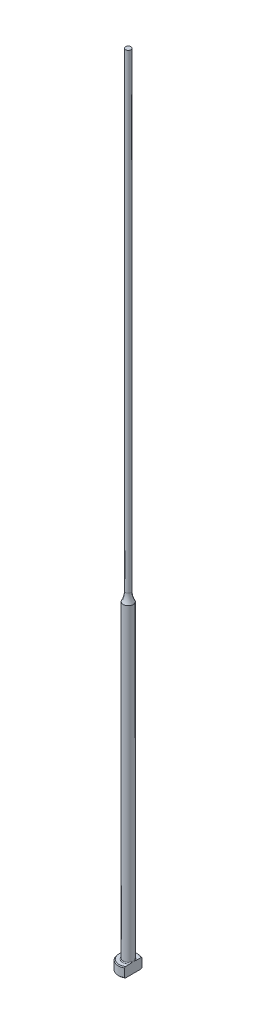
ISO-10303-21;
HEADER;
FILE_DESCRIPTION(('STEP AP214'),'2;1');
FILE_NAME('part.step','',(''),(''),'','','');
FILE_SCHEMA(('AUTOMOTIVE_DESIGN { 1 0 10303 214 1 1 1 1 }'));
ENDSEC;
DATA;
#1=APPLICATION_CONTEXT('core data for automotive mechanical design processes');
#2=APPLICATION_PROTOCOL_DEFINITION('international standard','automotive_design',2000,#1);
#3=PRODUCT_CONTEXT('',#1,'mechanical');
#4=PRODUCT('Part','Part','',(#3));
#5=PRODUCT_RELATED_PRODUCT_CATEGORY('part','',(#4));
#6=PRODUCT_DEFINITION_FORMATION('','',#4);
#7=PRODUCT_DEFINITION_CONTEXT('part definition',#1,'design');
#8=PRODUCT_DEFINITION('design','',#6,#7);
#9=PRODUCT_DEFINITION_SHAPE('','',#8);
#10=(LENGTH_UNIT() NAMED_UNIT(*) SI_UNIT(.MILLI.,.METRE.));
#11=(NAMED_UNIT(*) PLANE_ANGLE_UNIT() SI_UNIT($,.RADIAN.));
#12=(NAMED_UNIT(*) SI_UNIT($,.STERADIAN.) SOLID_ANGLE_UNIT());
#13=UNCERTAINTY_MEASURE_WITH_UNIT(LENGTH_MEASURE(1.E-05),#10,'distance_accuracy_value','');
#14=(GEOMETRIC_REPRESENTATION_CONTEXT(3) GLOBAL_UNCERTAINTY_ASSIGNED_CONTEXT((#13)) GLOBAL_UNIT_ASSIGNED_CONTEXT((#10,
#11,#12)) REPRESENTATION_CONTEXT('',''));
#15=CARTESIAN_POINT('',(0.,0.,0.));
#16=DIRECTION('',(0.,0.,1.));
#17=DIRECTION('',(1.,0.,0.));
#18=AXIS2_PLACEMENT_3D('',#15,#16,#17);
#19=CARTESIAN_POINT('',(-3.17499999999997,3.175,0.));
#20=DIRECTION('',(0.,1.,0.));
#21=DIRECTION('',(0.,0.,1.));
#22=AXIS2_PLACEMENT_3D('',#19,#20,#21);
#23=PLANE('',#22);
#24=CARTESIAN_POINT('',(0.,3.175,0.));
#25=DIRECTION('',(0.,1.,0.));
#26=DIRECTION('',(0.,0.,1.));
#27=AXIS2_PLACEMENT_3D('',#24,#25,#26);
#28=CIRCLE('',#27,2.92099999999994);
#29=CARTESIAN_POINT('',(1.58749999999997,3.175,-2.45195529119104));
#30=VERTEX_POINT('',#29);
#31=CARTESIAN_POINT('',(1.58749999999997,3.175,2.45195529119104));
#32=VERTEX_POINT('',#31);
#33=EDGE_CURVE('E105',#30,#32,#28,.T.);
#34=ORIENTED_EDGE('',*,*,#33,.T.);
#35=DIRECTION('',(0.,0.,1.));
#36=VECTOR('',#35,1.);
#37=CARTESIAN_POINT('',(1.58749999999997,3.17499999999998,2.74963065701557));
#38=LINE('',#37,#36);
#39=CARTESIAN_POINT('',(1.58749999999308,3.175,0.933255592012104));
#40=VERTEX_POINT('',#39);
#41=EDGE_CURVE('E126',#40,#32,#38,.T.);
#42=ORIENTED_EDGE('',*,*,#41,.F.);
#43=CARTESIAN_POINT('',(0.,3.175,0.));
#44=DIRECTION('',(0.,1.,0.));
#45=DIRECTION('',(0.,0.,1.));
#46=AXIS2_PLACEMENT_3D('',#43,#44,#45);
#47=CIRCLE('',#46,1.84149999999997);
#48=CARTESIAN_POINT('',(1.58749999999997,3.17500000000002,-0.933255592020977));
#49=VERTEX_POINT('',#48);
#50=EDGE_CURVE('E11',#40,#49,#47,.F.);
#51=ORIENTED_EDGE('',*,*,#50,.T.);
#52=EDGE_CURVE('E52',#30,#49,#38,.T.);
#53=ORIENTED_EDGE('',*,*,#52,.F.);
#54=EDGE_LOOP('',(#34,#42,#51,#53));
#55=FACE_BOUND('',#54,.T.);
#56=ADVANCED_FACE('F32',(#55),#23,.T.);
#57=CARTESIAN_POINT('',(0.,259.958771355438,0.));
#58=DIRECTION('',(0.,1.,0.));
#59=DIRECTION('',(0.,0.,1.));
#60=AXIS2_PLACEMENT_3D('',#57,#58,#59);
#61=CYLINDRICAL_SURFACE('',#60,3.17499999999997);
#62=CARTESIAN_POINT('',(0.,2.92100000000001,0.));
#63=DIRECTION('',(0.,1.,0.));
#64=DIRECTION('',(0.,0.,1.));
#65=AXIS2_PLACEMENT_3D('',#62,#63,#64);
#66=CIRCLE('',#65,3.17499999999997);
#67=CARTESIAN_POINT('',(1.58749999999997,2.92100000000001,2.74963065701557));
#68=VERTEX_POINT('',#67);
#69=CARTESIAN_POINT('',(1.58749999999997,2.92100000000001,-2.74963065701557));
#70=VERTEX_POINT('',#69);
#71=EDGE_CURVE('E98',#68,#70,#66,.F.);
#72=ORIENTED_EDGE('',*,*,#71,.T.);
#73=DIRECTION('',(0.,-1.,0.));
#74=VECTOR('',#73,1.);
#75=CARTESIAN_POINT('',(1.58749999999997,254.001,-2.74963065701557));
#76=LINE('',#75,#74);
#77=CARTESIAN_POINT('',(1.58749999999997,0.253999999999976,-2.74963065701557));
#78=VERTEX_POINT('',#77);
#79=EDGE_CURVE('E141',#70,#78,#76,.T.);
#80=ORIENTED_EDGE('',*,*,#79,.T.);
#81=CARTESIAN_POINT('',(0.,0.253999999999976,0.));
#82=DIRECTION('',(0.,-1.,0.));
#83=DIRECTION('',(0.,0.,-1.));
#84=AXIS2_PLACEMENT_3D('',#81,#82,#83);
#85=CIRCLE('',#84,3.17499999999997);
#86=CARTESIAN_POINT('',(1.58749999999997,0.253999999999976,2.74963065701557));
#87=VERTEX_POINT('',#86);
#88=EDGE_CURVE('E95',#78,#87,#85,.F.);
#89=ORIENTED_EDGE('',*,*,#88,.T.);
#90=DIRECTION('',(0.,-1.,0.));
#91=VECTOR('',#90,1.);
#92=CARTESIAN_POINT('',(1.58749999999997,254.001,2.74963065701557));
#93=LINE('',#92,#91);
#94=EDGE_CURVE('E88',#68,#87,#93,.T.);
#95=ORIENTED_EDGE('',*,*,#94,.F.);
#96=EDGE_LOOP('',(#72,#80,#89,#95));
#97=FACE_BOUND('',#96,.T.);
#98=ADVANCED_FACE('F191',(#97),#61,.T.);
#99=CARTESIAN_POINT('',(0.,0.,0.));
#100=DIRECTION('',(0.,-1.,0.));
#101=DIRECTION('',(0.,0.,-1.));
#102=AXIS2_PLACEMENT_3D('',#99,#100,#101);
#103=PLANE('',#102);
#104=CARTESIAN_POINT('',(0.,0.,0.));
#105=DIRECTION('',(0.,-1.,0.));
#106=DIRECTION('',(0.,0.,-1.));
#107=AXIS2_PLACEMENT_3D('',#104,#105,#106);
#108=CIRCLE('',#107,2.92100000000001);
#109=CARTESIAN_POINT('',(1.58749999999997,0.,2.45195529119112));
#110=VERTEX_POINT('',#109);
#111=CARTESIAN_POINT('',(1.58749999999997,0.,-2.45195529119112));
#112=VERTEX_POINT('',#111);
#113=EDGE_CURVE('E93',#110,#112,#108,.T.);
#114=ORIENTED_EDGE('',*,*,#113,.T.);
#115=DIRECTION('',(0.,0.,1.));
#116=VECTOR('',#115,1.);
#117=CARTESIAN_POINT('',(1.58749999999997,0.,2.74963065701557));
#118=LINE('',#117,#116);
#119=EDGE_CURVE('E78',#112,#110,#118,.T.);
#120=ORIENTED_EDGE('',*,*,#119,.T.);
#121=EDGE_LOOP('',(#114,#120));
#122=FACE_BOUND('',#121,.T.);
#123=ADVANCED_FACE('F97',(#122),#103,.T.);
#124=CARTESIAN_POINT('',(0.,3.17499999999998,0.));
#125=DIRECTION('',(0.,-1.,0.));
#126=DIRECTION('',(0.,0.,-1.));
#127=AXIS2_PLACEMENT_3D('',#124,#125,#126);
#128=CONICAL_SURFACE('',#127,2.92099999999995,0.785398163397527);
#129=ORIENTED_EDGE('',*,*,#71,.F.);
#130=CARTESIAN_POINT('',(1.58749999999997,-0.16162066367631,-6.0529050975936));
#131=CARTESIAN_POINT('',(1.58749999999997,-0.0288893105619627,-5.91567682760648));
#132=CARTESIAN_POINT('',(1.58749999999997,0.103699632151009,-5.7783103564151));
#133=CARTESIAN_POINT('',(1.58749999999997,0.368508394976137,-5.50321874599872));
#134=CARTESIAN_POINT('',(1.58749999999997,0.500728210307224,-5.36549360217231));
#135=CARTESIAN_POINT('',(1.58749999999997,0.764778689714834,-5.08953516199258));
#136=CARTESIAN_POINT('',(1.58749999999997,0.896609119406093,-4.9513016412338));
#137=CARTESIAN_POINT('',(1.58749999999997,1.15968706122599,-4.67428233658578));
#138=CARTESIAN_POINT('',(1.58749999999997,1.29093457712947,-4.53549655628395));
#139=CARTESIAN_POINT('',(1.58749999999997,1.55007705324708,-4.25997724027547));
#140=CARTESIAN_POINT('',(1.58749999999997,1.67798684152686,-4.12325766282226));
#141=CARTESIAN_POINT('',(1.58749999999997,1.9328486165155,-3.84892898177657));
#142=CARTESIAN_POINT('',(1.58749999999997,2.05980060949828,-3.71131988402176));
#143=CARTESIAN_POINT('',(1.58749999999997,2.31237508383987,-3.43493978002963));
#144=CARTESIAN_POINT('',(1.58749999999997,2.43799784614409,-3.29616903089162));
#145=CARTESIAN_POINT('',(1.58749999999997,2.68741369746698,-3.01699558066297));
#146=CARTESIAN_POINT('',(1.58749999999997,2.81120686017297,-2.8765929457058));
#147=CARTESIAN_POINT('',(1.58749999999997,3.00875865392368,-2.64816703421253));
#148=CARTESIAN_POINT('',(1.58749999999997,3.08336151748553,-2.56087478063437));
#149=CARTESIAN_POINT('',(1.58749999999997,3.2312387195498,-2.38515423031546));
#150=CARTESIAN_POINT('',(1.58749999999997,3.30451292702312,-2.29672582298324));
#151=CARTESIAN_POINT('',(1.58749999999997,3.45004422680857,-2.1174740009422));
#152=CARTESIAN_POINT('',(1.58749999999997,3.5222823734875,-2.02663514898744));
#153=CARTESIAN_POINT('',(1.58749999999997,3.66423097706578,-1.8430252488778));
#154=CARTESIAN_POINT('',(1.58749999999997,3.73394203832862,-1.75025467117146));
#155=CARTESIAN_POINT('',(1.58749999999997,3.87080633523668,-1.5606747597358));
#156=CARTESIAN_POINT('',(1.58749999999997,3.93790459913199,-1.46382547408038));
#157=CARTESIAN_POINT('',(1.58749999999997,4.06669147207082,-1.26632594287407));
#158=CARTESIAN_POINT('',(1.58749999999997,4.1283726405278,-1.16567073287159));
#159=CARTESIAN_POINT('',(1.58749999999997,4.21402252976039,-1.01165766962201));
#160=CARTESIAN_POINT('',(1.58749999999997,4.24127929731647,-0.960142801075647));
#161=CARTESIAN_POINT('',(1.58749999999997,4.2930979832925,-0.855780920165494));
#162=CARTESIAN_POINT('',(1.58749999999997,4.31765941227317,-0.802933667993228));
#163=CARTESIAN_POINT('',(1.58749999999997,4.38614656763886,-0.642461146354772));
#164=CARTESIAN_POINT('',(1.58749999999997,4.42510149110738,-0.532518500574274));
#165=CARTESIAN_POINT('',(1.58749999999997,4.46726244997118,-0.367680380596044));
#166=CARTESIAN_POINT('',(1.58749999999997,4.47844427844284,-0.314802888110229));
#167=CARTESIAN_POINT('',(1.58749999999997,4.49576654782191,-0.208209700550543));
#168=CARTESIAN_POINT('',(1.58749999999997,4.50190743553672,-0.154494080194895));
#169=CARTESIAN_POINT('',(1.58749999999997,4.50871296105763,-0.0468792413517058));
#170=CARTESIAN_POINT('',(1.58749999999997,4.5093945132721,0.00701889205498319));
#171=CARTESIAN_POINT('',(1.58749999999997,4.50527679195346,0.114606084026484));
#172=CARTESIAN_POINT('',(1.58749999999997,4.50047706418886,0.168295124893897));
#173=CARTESIAN_POINT('',(1.58749999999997,4.48579689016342,0.27448544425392));
#174=CARTESIAN_POINT('',(1.58749999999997,4.47596081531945,0.32699298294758));
#175=CARTESIAN_POINT('',(1.58749999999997,4.45181809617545,0.430974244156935));
#176=CARTESIAN_POINT('',(1.58749999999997,4.4375096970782,0.482447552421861));
#177=CARTESIAN_POINT('',(1.58749999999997,4.40502489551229,0.584460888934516));
#178=CARTESIAN_POINT('',(1.58749999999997,4.386827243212,0.634994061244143));
#179=CARTESIAN_POINT('',(1.58749999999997,4.34729308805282,0.734789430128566));
#180=CARTESIAN_POINT('',(1.58749999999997,4.3259572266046,0.784051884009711));
#181=CARTESIAN_POINT('',(1.58749999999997,4.25791922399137,0.930549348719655));
#182=CARTESIAN_POINT('',(1.58749999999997,4.20736047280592,1.0259880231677));
#183=CARTESIAN_POINT('',(1.58749999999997,4.0995545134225,1.21304313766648));
#184=CARTESIAN_POINT('',(1.58749999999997,4.04229912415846,1.30465471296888));
#185=CARTESIAN_POINT('',(1.58749999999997,3.92308746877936,1.48526211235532));
#186=CARTESIAN_POINT('',(1.58749999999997,3.86111349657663,1.57424615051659));
#187=CARTESIAN_POINT('',(1.58749999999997,3.73408621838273,1.74990003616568));
#188=CARTESIAN_POINT('',(1.58749999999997,3.66903444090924,1.83657099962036));
#189=CARTESIAN_POINT('',(1.58749999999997,3.53583371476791,2.00931764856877));
#190=CARTESIAN_POINT('',(1.58749999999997,3.46765527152,2.09537048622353));
#191=CARTESIAN_POINT('',(1.58749999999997,3.32960643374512,2.26611736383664));
#192=CARTESIAN_POINT('',(1.58749999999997,3.25973586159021,2.35081125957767));
#193=CARTESIAN_POINT('',(1.58749999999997,3.04858139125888,2.60290121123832));
#194=CARTESIAN_POINT('',(1.58749999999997,2.90542388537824,2.76872537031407));
#195=CARTESIAN_POINT('',(1.58749999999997,2.64069522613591,3.06970913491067));
#196=CARTESIAN_POINT('',(1.58749999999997,2.51959458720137,3.20528660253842));
#197=CARTESIAN_POINT('',(1.58749999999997,2.27590400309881,3.47510321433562));
#198=CARTESIAN_POINT('',(1.58749999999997,2.15331401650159,3.60934232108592));
#199=CARTESIAN_POINT('',(1.58749999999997,1.90694239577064,3.87695374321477));
#200=CARTESIAN_POINT('',(1.58749999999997,1.78315974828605,4.0103251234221));
#201=CARTESIAN_POINT('',(1.58749999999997,1.53478104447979,4.27630880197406));
#202=CARTESIAN_POINT('',(1.58749999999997,1.41018498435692,4.40892109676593));
#203=CARTESIAN_POINT('',(1.58749999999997,1.0457468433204,4.79499418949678));
#204=CARTESIAN_POINT('',(1.58749999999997,0.80507680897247,5.04767313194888));
#205=CARTESIAN_POINT('',(1.58749999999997,0.443121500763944,5.42550911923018));
#206=CARTESIAN_POINT('',(1.58749999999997,0.322378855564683,5.55118772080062));
#207=CARTESIAN_POINT('',(1.58749999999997,0.0805914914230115,5.80225207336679));
#208=CARTESIAN_POINT('',(1.58749999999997,-0.040453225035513,5.92763782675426));
#209=CARTESIAN_POINT('',(1.58749999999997,-0.161620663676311,6.0529050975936));
#210=B_SPLINE_CURVE_WITH_KNOTS('',3,(#130,#131,#132,#133,#134,#135,#136,#137,#138,#139,#140,
#141,#142,#143,#144,#145,#146,#147,#148,#149,#150,#151,#152,#153,#154,#155,#156,#157,#158,#159,
#160,#161,#162,#163,#164,#165,#166,#167,#168,#169,#170,#171,#172,#173,#174,#175,#176,#177,#178,
#179,#180,#181,#182,#183,#184,#185,#186,#187,#188,#189,#190,#191,#192,#193,#194,#195,#196,#197,
#198,#199,#200,#201,#202,#203,#204,#205,#206,#207,#208,#209),.UNSPECIFIED.,.F.,.F.,(4,2,2,2,2,2,
2,2,2,2,2,2,2,2,2,2,2,2,2,2,2,2,2,2,2,2,2,2,2,2,2,2,2,2,2,2,2,2,2,4),(0.,0.572750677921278,
1.14550874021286,1.71856057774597,2.29160869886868,2.85328006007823,3.4149477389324,
3.97649423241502,4.53801804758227,4.88249307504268,5.22700189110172,5.5751532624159,
5.92322081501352,6.27657800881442,6.63041319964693,6.80518126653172,6.9799810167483,
7.3282426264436,7.49018491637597,7.65211285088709,7.81353889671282,7.97497832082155,
8.13501929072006,8.29512313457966,8.45612518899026,8.61709438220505,8.94062993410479,
9.2645649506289,9.58978187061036,9.91483894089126,10.2441741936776,10.5735441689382,
11.2306812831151,11.7760337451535,12.3214014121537,12.8672825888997,13.4131663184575,
14.4600164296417,14.9828595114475,15.5056983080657),.UNSPECIFIED.);
#211=EDGE_CURVE('E118',#32,#68,#210,.T.);
#212=ORIENTED_EDGE('',*,*,#211,.F.);
#213=ORIENTED_EDGE('',*,*,#33,.F.);
#214=EDGE_CURVE('E117',#70,#30,#210,.T.);
#215=ORIENTED_EDGE('',*,*,#214,.F.);
#216=EDGE_LOOP('',(#129,#212,#213,#215));
#217=FACE_BOUND('',#216,.T.);
#218=ADVANCED_FACE('F162',(#217),#128,.T.);
#219=CARTESIAN_POINT('',(0.,0.253999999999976,0.));
#220=DIRECTION('',(0.,1.,0.));
#221=DIRECTION('',(0.,0.,1.));
#222=AXIS2_PLACEMENT_3D('',#219,#220,#221);
#223=CONICAL_SURFACE('',#222,3.17499999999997,0.785398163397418);
#224=ORIENTED_EDGE('',*,*,#88,.F.);
#225=CARTESIAN_POINT('',(1.58749999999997,3.33662066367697,6.0529050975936));
#226=CARTESIAN_POINT('',(1.58749999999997,3.20388931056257,5.91567682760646));
#227=CARTESIAN_POINT('',(1.58749999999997,3.07130036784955,5.77831035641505));
#228=CARTESIAN_POINT('',(1.58749999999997,2.80649160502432,5.50321874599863));
#229=CARTESIAN_POINT('',(1.58749999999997,2.67427178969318,5.3654936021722));
#230=CARTESIAN_POINT('',(1.58749999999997,2.41022131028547,5.08953516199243));
#231=CARTESIAN_POINT('',(1.58749999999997,2.27839088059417,4.95130164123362));
#232=CARTESIAN_POINT('',(1.58749999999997,2.01531293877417,4.67428233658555));
#233=CARTESIAN_POINT('',(1.58749999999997,1.88406542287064,4.5354965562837));
#234=CARTESIAN_POINT('',(1.58749999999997,1.62492294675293,4.25997724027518));
#235=CARTESIAN_POINT('',(1.58749999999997,1.49701315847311,4.12325766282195));
#236=CARTESIAN_POINT('',(1.58749999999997,1.24215138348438,3.84892898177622));
#237=CARTESIAN_POINT('',(1.58749999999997,1.11519939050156,3.71131988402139));
#238=CARTESIAN_POINT('',(1.58749999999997,0.862624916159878,3.43493978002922));
#239=CARTESIAN_POINT('',(1.58749999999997,0.737002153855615,3.29616903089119));
#240=CARTESIAN_POINT('',(1.58749999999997,0.487586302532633,3.01699558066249));
#241=CARTESIAN_POINT('',(1.58749999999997,0.363793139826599,2.8765929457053));
#242=CARTESIAN_POINT('',(1.58749999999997,0.166241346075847,2.64816703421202));
#243=CARTESIAN_POINT('',(1.58749999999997,0.0916384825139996,2.56087478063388));
#244=CARTESIAN_POINT('',(1.58749999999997,-0.0562387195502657,2.385154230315));
#245=CARTESIAN_POINT('',(1.58749999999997,-0.129512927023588,2.29672582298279));
#246=CARTESIAN_POINT('',(1.58749999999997,-0.27504422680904,2.11747400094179));
#247=CARTESIAN_POINT('',(1.58749999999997,-0.347282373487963,2.02663514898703));
#248=CARTESIAN_POINT('',(1.58749999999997,-0.489230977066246,1.84302524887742));
#249=CARTESIAN_POINT('',(1.58749999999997,-0.558942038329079,1.7502546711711));
#250=CARTESIAN_POINT('',(1.58749999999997,-0.695806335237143,1.56067475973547));
#251=CARTESIAN_POINT('',(1.58749999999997,-0.762904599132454,1.46382547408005));
#252=CARTESIAN_POINT('',(1.58749999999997,-0.891691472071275,1.26632594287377));
#253=CARTESIAN_POINT('',(1.58749999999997,-0.953372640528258,1.16567073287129));
#254=CARTESIAN_POINT('',(1.58749999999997,-1.03902252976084,1.01165766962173));
#255=CARTESIAN_POINT('',(1.58749999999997,-1.06627929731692,0.960142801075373));
#256=CARTESIAN_POINT('',(1.58749999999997,-1.11809798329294,0.85578092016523));
#257=CARTESIAN_POINT('',(1.58749999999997,-1.14265941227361,0.802933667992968));
#258=CARTESIAN_POINT('',(1.58749999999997,-1.21114656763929,0.642461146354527));
#259=CARTESIAN_POINT('',(1.58749999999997,-1.2501014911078,0.532518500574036));
#260=CARTESIAN_POINT('',(1.58749999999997,-1.29226244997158,0.367680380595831));
#261=CARTESIAN_POINT('',(1.58749999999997,-1.30344427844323,0.314802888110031));
#262=CARTESIAN_POINT('',(1.58749999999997,-1.32076654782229,0.208209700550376));
#263=CARTESIAN_POINT('',(1.58749999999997,-1.3269074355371,0.154494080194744));
#264=CARTESIAN_POINT('',(1.58749999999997,-1.333712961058,0.0468792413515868));
#265=CARTESIAN_POINT('',(1.58749999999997,-1.33439451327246,-0.00701889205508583));
#266=CARTESIAN_POINT('',(1.58749999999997,-1.33027679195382,-0.114606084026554));
#267=CARTESIAN_POINT('',(1.58749999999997,-1.32547706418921,-0.168295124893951));
#268=CARTESIAN_POINT('',(1.58749999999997,-1.31079689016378,-0.274485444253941));
#269=CARTESIAN_POINT('',(1.58749999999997,-1.3009608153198,-0.326992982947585));
#270=CARTESIAN_POINT('',(1.58749999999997,-1.27681809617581,-0.430974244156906));
#271=CARTESIAN_POINT('',(1.58749999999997,-1.26250969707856,-0.482447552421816));
#272=CARTESIAN_POINT('',(1.58749999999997,-1.23002489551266,-0.584460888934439));
#273=CARTESIAN_POINT('',(1.58749999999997,-1.21182724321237,-0.634994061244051));
#274=CARTESIAN_POINT('',(1.58749999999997,-1.1722930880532,-0.734789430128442));
#275=CARTESIAN_POINT('',(1.58749999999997,-1.15095722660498,-0.784051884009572));
#276=CARTESIAN_POINT('',(1.58749999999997,-1.08291922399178,-0.93054934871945));
#277=CARTESIAN_POINT('',(1.58749999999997,-1.03236047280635,-1.02598802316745));
#278=CARTESIAN_POINT('',(1.58749999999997,-0.924554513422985,-1.21304313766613));
#279=CARTESIAN_POINT('',(1.58749999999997,-0.86729912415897,-1.30465471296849));
#280=CARTESIAN_POINT('',(1.58749999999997,-0.748087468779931,-1.48526211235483));
#281=CARTESIAN_POINT('',(1.58749999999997,-0.686113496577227,-1.57424615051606));
#282=CARTESIAN_POINT('',(1.58749999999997,-0.55908621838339,-1.74990003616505));
#283=CARTESIAN_POINT('',(1.58749999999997,-0.494034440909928,-1.83657099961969));
#284=CARTESIAN_POINT('',(1.58749999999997,-0.360833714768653,-2.00931764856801));
#285=CARTESIAN_POINT('',(1.58749999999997,-0.292655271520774,-2.09537048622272));
#286=CARTESIAN_POINT('',(1.58749999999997,-0.154606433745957,-2.26611736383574));
#287=CARTESIAN_POINT('',(1.58749999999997,-0.0847358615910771,-2.35081125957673));
#288=CARTESIAN_POINT('',(1.58749999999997,0.126418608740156,-2.60290121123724));
#289=CARTESIAN_POINT('',(1.58749999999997,0.269576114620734,-2.76872537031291));
#290=CARTESIAN_POINT('',(1.58749999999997,0.534304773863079,-3.06970913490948));
#291=CARTESIAN_POINT('',(1.58749999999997,0.655405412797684,-3.20528660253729));
#292=CARTESIAN_POINT('',(1.58749999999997,0.899095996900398,-3.47510321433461));
#293=CARTESIAN_POINT('',(1.58749999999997,1.02168598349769,-3.60934232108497));
#294=CARTESIAN_POINT('',(1.58749999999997,1.26805760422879,-3.87695374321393));
#295=CARTESIAN_POINT('',(1.58749999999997,1.39184025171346,-4.01032512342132));
#296=CARTESIAN_POINT('',(1.58749999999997,1.64021895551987,-4.2763088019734));
#297=CARTESIAN_POINT('',(1.58749999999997,1.76481501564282,-4.40892109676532));
#298=CARTESIAN_POINT('',(1.58749999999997,2.12925315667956,-4.79499418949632));
#299=CARTESIAN_POINT('',(1.58749999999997,2.36992319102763,-5.04767313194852));
#300=CARTESIAN_POINT('',(1.58749999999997,2.73187849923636,-5.42550911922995));
#301=CARTESIAN_POINT('',(1.58749999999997,2.85262114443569,-5.55118772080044));
#302=CARTESIAN_POINT('',(1.58749999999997,3.09440850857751,-5.8022520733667));
#303=CARTESIAN_POINT('',(1.58749999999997,3.2154532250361,-5.92763782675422));
#304=CARTESIAN_POINT('',(1.58749999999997,3.33662066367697,-6.0529050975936));
#305=B_SPLINE_CURVE_WITH_KNOTS('',3,(#225,#226,#227,#228,#229,#230,#231,#232,#233,#234,#235,
#236,#237,#238,#239,#240,#241,#242,#243,#244,#245,#246,#247,#248,#249,#250,#251,#252,#253,#254,
#255,#256,#257,#258,#259,#260,#261,#262,#263,#264,#265,#266,#267,#268,#269,#270,#271,#272,#273,
#274,#275,#276,#277,#278,#279,#280,#281,#282,#283,#284,#285,#286,#287,#288,#289,#290,#291,#292,
#293,#294,#295,#296,#297,#298,#299,#300,#301,#302,#303,#304),.UNSPECIFIED.,.F.,.F.,(4,2,2,2,2,2,
2,2,2,2,2,2,2,2,2,2,2,2,2,2,2,2,2,2,2,2,2,2,2,2,2,2,2,2,2,2,2,2,2,4),(0.,0.57275067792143,
1.14550874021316,1.71856057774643,2.29160869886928,2.85328006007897,3.41494773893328,
3.97649423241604,4.53801804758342,4.88249307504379,5.2270018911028,5.57515326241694,
5.92322081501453,6.27657800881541,6.63041319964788,6.80518126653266,6.97998101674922,
7.32824262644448,7.49018491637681,7.65211285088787,7.81353889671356,7.97497832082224,
8.1350192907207,8.29512313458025,8.45612518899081,8.61709438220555,8.94062993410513,
9.26456495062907,9.58978187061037,9.91483894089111,10.2441741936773,10.5735441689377,
11.2306812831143,11.776033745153,12.3214014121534,12.8672825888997,13.4131663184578,
14.4600164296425,14.9828595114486,15.505698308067),.UNSPECIFIED.);
#306=EDGE_CURVE('E81',#112,#78,#305,.T.);
#307=ORIENTED_EDGE('',*,*,#306,.F.);
#308=ORIENTED_EDGE('',*,*,#113,.F.);
#309=EDGE_CURVE('E84',#87,#110,#305,.T.);
#310=ORIENTED_EDGE('',*,*,#309,.F.);
#311=EDGE_LOOP('',(#224,#307,#308,#310));
#312=FACE_BOUND('',#311,.T.);
#313=ADVANCED_FACE('F92',(#312),#223,.T.);
#314=CARTESIAN_POINT('',(0.,3.42900000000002,0.));
#315=DIRECTION('',(0.,1.,0.));
#316=DIRECTION('',(0.,0.,1.));
#317=AXIS2_PLACEMENT_3D('',#314,#315,#316);
#318=TOROIDAL_SURFACE('',#317,1.84149999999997,0.254);
#319=CARTESIAN_POINT('',(1.58749999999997,3.42900000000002,0.));
#320=CARTESIAN_POINT('',(1.58749999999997,3.42899942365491,-1.9220514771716E-10));
#321=CARTESIAN_POINT('',(1.58749999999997,3.42899884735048,-1.2261161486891E-07));
#322=CARTESIAN_POINT('',(1.58749999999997,3.42899773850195,-5.09676365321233E-07));
#323=CARTESIAN_POINT('',(1.58749999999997,3.42899720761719,-7.78176328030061E-07));
#324=CARTESIAN_POINT('',(1.58749999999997,3.42899614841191,-1.42307272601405E-06));
#325=CARTESIAN_POINT('',(1.58749999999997,3.42899562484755,-1.80713867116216E-06));
#326=CARTESIAN_POINT('',(1.58749999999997,3.42899463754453,-2.63494846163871E-06));
#327=CARTESIAN_POINT('',(1.58749999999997,3.42899417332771,-3.07814756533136E-06));
#328=CARTESIAN_POINT('',(1.58749999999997,3.42899261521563,-4.66897357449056E-06));
#329=CARTESIAN_POINT('',(1.58749999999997,3.42899159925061,-5.89404908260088E-06));
#330=CARTESIAN_POINT('',(1.58749999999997,3.42898979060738,-8.42427511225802E-06));
#331=CARTESIAN_POINT('',(1.58749999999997,3.42898899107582,-9.7248057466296E-06));
#332=CARTESIAN_POINT('',(1.58749999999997,3.42898598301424,-1.48060601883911E-05));
#333=CARTESIAN_POINT('',(1.58749999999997,3.42898393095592,-1.86838281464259E-05));
#334=CARTESIAN_POINT('',(1.58749999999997,3.42898057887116,-2.63261117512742E-05));
#335=CARTESIAN_POINT('',(1.58749999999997,3.42897922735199,-3.00687417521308E-05));
#336=CARTESIAN_POINT('',(1.58749999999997,3.42897347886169,-4.60276298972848E-05));
#337=CARTESIAN_POINT('',(1.58749999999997,3.42896911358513,-5.8247019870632E-05));
#338=CARTESIAN_POINT('',(1.58749999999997,3.42896211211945,-8.11070097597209E-05));
#339=CARTESIAN_POINT('',(1.58749999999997,3.42895931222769,-9.16953114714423E-05));
#340=CARTESIAN_POINT('',(1.58749999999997,3.42893712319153,-0.000168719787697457));
#341=CARTESIAN_POINT('',(1.58749999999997,3.42890881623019,-0.000232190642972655));
#342=CARTESIAN_POINT('',(1.58749999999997,3.42880276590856,-0.000479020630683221));
#343=CARTESIAN_POINT('',(1.58749999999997,3.42873165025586,-0.00066443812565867));
#344=CARTESIAN_POINT('',(1.58749999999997,3.42845137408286,-0.0013844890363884));
#345=CARTESIAN_POINT('',(1.58749999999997,3.42823526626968,-0.00191701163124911));
#346=CARTESIAN_POINT('',(1.58749999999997,3.42735449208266,-0.00409774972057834));
#347=CARTESIAN_POINT('',(1.58749999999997,3.42669768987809,-0.00574830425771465));
#348=CARTESIAN_POINT('',(1.58749999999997,3.4174405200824,-0.0289985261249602));
#349=CARTESIAN_POINT('',(1.58749999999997,3.40878325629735,-0.0505816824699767));
#350=CARTESIAN_POINT('',(1.58749999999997,3.39189297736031,-0.0929947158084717));
#351=CARTESIAN_POINT('',(1.58749999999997,3.38365605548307,-0.11382315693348));
#352=CARTESIAN_POINT('',(1.58749999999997,3.36635393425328,-0.157956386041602));
#353=CARTESIAN_POINT('',(1.58749999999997,3.35730391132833,-0.181267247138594));
#354=CARTESIAN_POINT('',(1.58749999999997,3.33936775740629,-0.228222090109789));
#355=CARTESIAN_POINT('',(1.58749999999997,3.33048420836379,-0.25186705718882));
#356=CARTESIAN_POINT('',(1.58749999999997,3.30894496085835,-0.310512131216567));
#357=CARTESIAN_POINT('',(1.58749999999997,3.29649449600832,-0.345588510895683));
#358=CARTESIAN_POINT('',(1.58749999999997,3.27296975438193,-0.415278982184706));
#359=CARTESIAN_POINT('',(1.58749999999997,3.26186987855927,-0.449884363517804));
#360=CARTESIAN_POINT('',(1.58749999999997,3.2395832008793,-0.524471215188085));
#361=CARTESIAN_POINT('',(1.58749999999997,3.22860862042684,-0.564517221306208));
#362=CARTESIAN_POINT('',(1.58749999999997,3.20902534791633,-0.645529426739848));
#363=CARTESIAN_POINT('',(1.58749999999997,3.20043582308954,-0.686500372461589));
#364=CARTESIAN_POINT('',(1.58749999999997,3.18611712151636,-0.771546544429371));
#365=CARTESIAN_POINT('',(1.58749999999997,3.18059550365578,-0.815658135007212));
#366=CARTESIAN_POINT('',(1.58749999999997,3.17455396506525,-0.904117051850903));
#367=CARTESIAN_POINT('',(1.58749999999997,3.17401361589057,-0.948462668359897));
#368=CARTESIAN_POINT('',(1.58749999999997,3.17898948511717,-1.02531896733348));
#369=CARTESIAN_POINT('',(1.58749999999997,3.1829739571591,-1.05792141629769));
#370=CARTESIAN_POINT('',(1.58749999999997,3.19569167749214,-1.12184393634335));
#371=CARTESIAN_POINT('',(1.58749999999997,3.20436049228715,-1.1531753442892));
#372=CARTESIAN_POINT('',(1.58749999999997,3.22236152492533,-1.19946468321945));
#373=CARTESIAN_POINT('',(1.58749999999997,3.2295150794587,-1.21526783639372));
#374=CARTESIAN_POINT('',(1.58749999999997,3.24587062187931,-1.24583726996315));
#375=CARTESIAN_POINT('',(1.58749999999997,3.25507530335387,-1.26060215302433));
#376=CARTESIAN_POINT('',(1.58749999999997,3.27378481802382,-1.28575815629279));
#377=CARTESIAN_POINT('',(1.58749999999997,3.28289001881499,-1.29644383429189));
#378=CARTESIAN_POINT('',(1.58749999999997,3.30268460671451,-1.31623154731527));
#379=CARTESIAN_POINT('',(1.58749999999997,3.31337067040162,-1.32533681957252));
#380=CARTESIAN_POINT('',(1.58749999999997,3.33349977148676,-1.33941140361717));
#381=CARTESIAN_POINT('',(1.58749999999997,3.34261446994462,-1.34484814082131));
#382=CARTESIAN_POINT('',(1.58749999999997,3.36161455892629,-1.35416329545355));
#383=CARTESIAN_POINT('',(1.58749999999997,3.37149946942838,-1.35804267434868));
#384=CARTESIAN_POINT('',(1.58749999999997,3.39188678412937,-1.36398436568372));
#385=CARTESIAN_POINT('',(1.58749999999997,3.40239309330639,-1.36603350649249));
#386=CARTESIAN_POINT('',(1.58749999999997,3.42360372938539,-1.3680840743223));
#387=CARTESIAN_POINT('',(1.58749999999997,3.43430795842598,-1.36808648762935));
#388=CARTESIAN_POINT('',(1.58749999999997,3.45433283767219,-1.36616208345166));
#389=CARTESIAN_POINT('',(1.58749999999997,3.46367506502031,-1.36444960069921));
#390=CARTESIAN_POINT('',(1.58749999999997,3.48195519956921,-1.35953338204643));
#391=CARTESIAN_POINT('',(1.58749999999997,3.49089304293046,-1.3563294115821));
#392=CARTESIAN_POINT('',(1.58749999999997,3.50850302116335,-1.34848006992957));
#393=CARTESIAN_POINT('',(1.58749999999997,3.5171531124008,-1.34378578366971));
#394=CARTESIAN_POINT('',(1.58749999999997,3.53371257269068,-1.33324445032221));
#395=CARTESIAN_POINT('',(1.58749999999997,3.54162163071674,-1.32739692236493));
#396=CARTESIAN_POINT('',(1.58749999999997,3.56107121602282,-1.31107304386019));
#397=CARTESIAN_POINT('',(1.58749999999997,3.57202221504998,-1.29989286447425));
#398=CARTESIAN_POINT('',(1.58749999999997,3.59202509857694,-1.27593566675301));
#399=CARTESIAN_POINT('',(1.58749999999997,3.60107086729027,-1.26315370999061));
#400=CARTESIAN_POINT('',(1.58749999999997,3.62186023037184,-1.22930733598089));
#401=CARTESIAN_POINT('',(1.58749999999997,3.63240584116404,-1.20751096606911));
#402=CARTESIAN_POINT('',(1.58749999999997,3.65004643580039,-1.16266144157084));
#403=CARTESIAN_POINT('',(1.58749999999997,3.65714435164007,-1.13960937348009));
#404=CARTESIAN_POINT('',(1.58749999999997,3.67265428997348,-1.07603916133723));
#405=CARTESIAN_POINT('',(1.58749999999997,3.67834921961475,-1.03486686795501));
#406=CARTESIAN_POINT('',(1.58749999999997,3.68382880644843,-0.951558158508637));
#407=CARTESIAN_POINT('',(1.58749999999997,3.68350976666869,-0.909417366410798));
#408=CARTESIAN_POINT('',(1.58749999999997,3.67745397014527,-0.811383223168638));
#409=CARTESIAN_POINT('',(1.58749999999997,3.66993873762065,-0.755610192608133));
#410=CARTESIAN_POINT('',(1.58749999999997,3.64933373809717,-0.644937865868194));
#411=CARTESIAN_POINT('',(1.58749999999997,3.63621897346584,-0.59004364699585));
#412=CARTESIAN_POINT('',(1.58749999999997,3.60740922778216,-0.485757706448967));
#413=CARTESIAN_POINT('',(1.58749999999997,3.59201096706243,-0.436281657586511));
#414=CARTESIAN_POINT('',(1.58749999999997,3.55922497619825,-0.338551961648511));
#415=CARTESIAN_POINT('',(1.58749999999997,3.5418584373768,-0.290291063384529));
#416=CARTESIAN_POINT('',(1.58749999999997,3.51760237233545,-0.225557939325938));
#417=CARTESIAN_POINT('',(1.58749999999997,3.51126413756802,-0.208874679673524));
#418=CARTESIAN_POINT('',(1.58749999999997,3.49830042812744,-0.17512392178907));
#419=CARTESIAN_POINT('',(1.58749999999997,3.49167176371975,-0.158057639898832));
#420=CARTESIAN_POINT('',(1.58749999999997,3.47585523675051,-0.117638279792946));
#421=CARTESIAN_POINT('',(1.58749999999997,3.46662970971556,-0.0943002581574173));
#422=CARTESIAN_POINT('',(1.58749999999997,3.44889695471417,-0.0497824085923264));
#423=CARTESIAN_POINT('',(1.58749999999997,3.44040039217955,-0.028598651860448));
#424=CARTESIAN_POINT('',(1.58749999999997,3.43130364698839,-0.00575168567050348));
#425=CARTESIAN_POINT('',(1.58749999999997,3.43064818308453,-0.00410451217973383));
#426=CARTESIAN_POINT('',(1.58749999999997,3.42976776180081,-0.00192459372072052));
#427=CARTESIAN_POINT('',(1.58749999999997,3.42955062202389,-0.00138952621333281));
#428=CARTESIAN_POINT('',(1.58749999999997,3.42926908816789,-0.000666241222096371));
#429=CARTESIAN_POINT('',(1.58749999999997,3.42919771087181,-0.000480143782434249));
#430=CARTESIAN_POINT('',(1.58749999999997,3.42909131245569,-0.000232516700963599));
#431=CARTESIAN_POINT('',(1.58749999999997,3.42906294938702,-0.000168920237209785));
#432=CARTESIAN_POINT('',(1.58749999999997,3.42904072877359,-9.17527162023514E-05));
#433=CARTESIAN_POINT('',(1.58749999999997,3.42903792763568,-8.11550293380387E-05));
#434=CARTESIAN_POINT('',(1.58749999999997,3.42903091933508,-5.82743948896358E-05));
#435=CARTESIAN_POINT('',(1.58749999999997,3.42902654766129,-4.60440001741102E-05));
#436=CARTESIAN_POINT('',(1.58749999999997,3.42902079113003,-3.00727682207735E-05));
#437=CARTESIAN_POINT('',(1.58749999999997,3.42901943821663,-2.63286807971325E-05));
#438=CARTESIAN_POINT('',(1.58749999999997,3.42901608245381,-1.86836529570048E-05));
#439=CARTESIAN_POINT('',(1.58749999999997,3.4290140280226,-1.48046517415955E-05));
#440=CARTESIAN_POINT('',(1.58749999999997,3.42901101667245,-9.72223943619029E-06));
#441=CARTESIAN_POINT('',(1.58749999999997,3.42901021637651,-8.42159649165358E-06));
#442=CARTESIAN_POINT('',(1.58749999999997,3.42900840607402,-5.89129729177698E-06));
#443=CARTESIAN_POINT('',(1.58749999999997,3.42900738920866,-4.66626867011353E-06));
#444=CARTESIAN_POINT('',(1.58749999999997,3.42900582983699,-3.07568803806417E-06));
#445=CARTESIAN_POINT('',(1.58749999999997,3.42900536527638,-2.63259565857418E-06));
#446=CARTESIAN_POINT('',(1.58749999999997,3.4290043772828,-1.80506085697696E-06));
#447=CARTESIAN_POINT('',(1.58749999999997,3.42900385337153,-1.42116387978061E-06));
#448=CARTESIAN_POINT('',(1.58749999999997,3.42900279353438,-7.76675643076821E-07));
#449=CARTESIAN_POINT('',(1.58749999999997,3.42900226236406,-5.08406487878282E-07));
#450=CARTESIAN_POINT('',(1.58749999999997,3.42900115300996,-1.21901887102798E-07));
#451=CARTESIAN_POINT('',(1.58749999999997,3.42900057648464,1.92251677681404E-10));
#452=CARTESIAN_POINT('',(1.58749999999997,3.42900000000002,0.));
#453=B_SPLINE_CURVE_WITH_KNOTS('',3,(#319,#320,#321,#322,#323,#324,#325,#326,#327,#328,#329,
#330,#331,#332,#333,#334,#335,#336,#337,#338,#339,#340,#341,#342,#343,#344,#345,#346,#347,#348,
#349,#350,#351,#352,#353,#354,#355,#356,#357,#358,#359,#360,#361,#362,#363,#364,#365,#366,#367,
#368,#369,#370,#371,#372,#373,#374,#375,#376,#377,#378,#379,#380,#381,#382,#383,#384,#385,#386,
#387,#388,#389,#390,#391,#392,#393,#394,#395,#396,#397,#398,#399,#400,#401,#402,#403,#404,#405,
#406,#407,#408,#409,#410,#411,#412,#413,#414,#415,#416,#417,#418,#419,#420,#421,#422,#423,#424,
#425,#426,#427,#428,#429,#430,#431,#432,#433,#434,#435,#436,#437,#438,#439,#440,#441,#442,#443,
#444,#445,#446,#447,#448,#449,#450,#451,#452),.UNSPECIFIED.,.T.,.F.,(4,2,2,2,2,2,2,2,2,2,2,2,2,
2,2,2,2,2,2,2,2,2,2,2,2,2,2,2,2,2,2,2,2,2,2,2,2,2,2,2,2,2,2,2,2,2,2,2,2,2,2,2,2,2,2,2,2,2,2,2,2,
2,2,2,2,2,4),(0.,1.72815458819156E-06,3.50429255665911E-06,5.44431004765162E-06,
7.3675525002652E-06,1.2119089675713E-05,1.66953775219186E-05,2.98160400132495E-05,
4.17409564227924E-05,8.0660475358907E-05,0.000113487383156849,0.000321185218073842,
0.000917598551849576,0.00264089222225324,0.00797105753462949,0.0777276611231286,
0.144923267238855,0.219939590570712,0.295714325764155,0.407362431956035,0.516367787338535,
0.640878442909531,0.766362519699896,0.899536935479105,1.03216495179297,1.13045740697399,
1.22743103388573,1.27935899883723,1.33135556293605,1.37333248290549,1.41522237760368,
1.44693946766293,1.47863694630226,1.51056074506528,1.54246916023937,1.57083210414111,
1.59919951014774,1.62861579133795,1.65804436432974,1.70472658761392,1.75155645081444,
1.82378709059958,1.89595619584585,2.01995471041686,2.1460932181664,2.31447224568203,
2.48361094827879,2.6389891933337,2.79283011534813,2.84637031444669,2.9012946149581,
2.97658236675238,3.04504771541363,3.05036697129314,3.05209849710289,3.05269709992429,
3.05290520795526,3.05293806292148,3.05297701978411,3.05298895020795,3.05300207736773,
3.05300665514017,3.0530114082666,3.05301333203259,3.05301527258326,3.05301704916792,
3.05301877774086),.UNSPECIFIED.);
#454=CARTESIAN_POINT('',(1.58749999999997,3.42900000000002,0.));
#455=VERTEX_POINT('',#454);
#456=EDGE_CURVE('E47',#455,#49,#453,.T.);
#457=ORIENTED_EDGE('',*,*,#456,.T.);
#458=ORIENTED_EDGE('',*,*,#50,.F.);
#459=CARTESIAN_POINT('',(1.58749999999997,3.42900000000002,0.));
#460=CARTESIAN_POINT('',(1.58749999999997,3.42900057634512,1.9220512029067E-10));
#461=CARTESIAN_POINT('',(1.58749999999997,3.42900115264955,1.22611614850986E-07));
#462=CARTESIAN_POINT('',(1.58749999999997,3.42900226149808,5.09676365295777E-07));
#463=CARTESIAN_POINT('',(1.58749999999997,3.42900279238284,7.78176328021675E-07));
#464=CARTESIAN_POINT('',(1.58749999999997,3.42900385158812,1.42307272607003E-06));
#465=CARTESIAN_POINT('',(1.58749999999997,3.42900437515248,1.80713867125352E-06));
#466=CARTESIAN_POINT('',(1.58749999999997,3.4290053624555,2.63494846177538E-06));
#467=CARTESIAN_POINT('',(1.58749999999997,3.42900582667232,3.0781475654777E-06));
#468=CARTESIAN_POINT('',(1.58749999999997,3.4290073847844,4.66897357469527E-06));
#469=CARTESIAN_POINT('',(1.58749999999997,3.42900840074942,5.89404908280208E-06));
#470=CARTESIAN_POINT('',(1.58749999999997,3.42901020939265,8.42427511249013E-06));
#471=CARTESIAN_POINT('',(1.58749999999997,3.42901100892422,9.72480574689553E-06));
#472=CARTESIAN_POINT('',(1.58749999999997,3.42901401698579,1.48060601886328E-05));
#473=CARTESIAN_POINT('',(1.58749999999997,3.42901606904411,1.86838281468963E-05));
#474=CARTESIAN_POINT('',(1.58749999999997,3.42901942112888,2.63261117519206E-05));
#475=CARTESIAN_POINT('',(1.58749999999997,3.42902077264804,3.00687417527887E-05));
#476=CARTESIAN_POINT('',(1.58749999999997,3.42902652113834,4.60276298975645E-05));
#477=CARTESIAN_POINT('',(1.58749999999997,3.4290308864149,5.82470198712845E-05));
#478=CARTESIAN_POINT('',(1.58749999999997,3.42903788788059,8.11070097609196E-05));
#479=CARTESIAN_POINT('',(1.58749999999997,3.42904068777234,9.16953114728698E-05));
#480=CARTESIAN_POINT('',(1.58749999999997,3.4290628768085,0.000168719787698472));
#481=CARTESIAN_POINT('',(1.58749999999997,3.42909118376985,0.000232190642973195));
#482=CARTESIAN_POINT('',(1.58749999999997,3.42919723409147,0.000479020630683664));
#483=CARTESIAN_POINT('',(1.58749999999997,3.42926834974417,0.000664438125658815));
#484=CARTESIAN_POINT('',(1.58749999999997,3.42954862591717,0.00138448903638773));
#485=CARTESIAN_POINT('',(1.58749999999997,3.42976473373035,0.00191701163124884));
#486=CARTESIAN_POINT('',(1.58749999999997,3.43064550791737,0.00409774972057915));
#487=CARTESIAN_POINT('',(1.58749999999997,3.43130231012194,0.00574830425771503));
#488=CARTESIAN_POINT('',(1.58749999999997,3.44055947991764,0.0289985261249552));
#489=CARTESIAN_POINT('',(1.58749999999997,3.44921674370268,0.0505816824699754));
#490=CARTESIAN_POINT('',(1.58749999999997,3.46610702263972,0.0929947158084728));
#491=CARTESIAN_POINT('',(1.58749999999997,3.47434394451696,0.11382315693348));
#492=CARTESIAN_POINT('',(1.58749999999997,3.49164606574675,0.157956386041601));
#493=CARTESIAN_POINT('',(1.58749999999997,3.5006960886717,0.181267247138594));
#494=CARTESIAN_POINT('',(1.58749999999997,3.51863224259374,0.228222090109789));
#495=CARTESIAN_POINT('',(1.58749999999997,3.52751579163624,0.25186705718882));
#496=CARTESIAN_POINT('',(1.58749999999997,3.54905503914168,0.310512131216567));
#497=CARTESIAN_POINT('',(1.58749999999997,3.56150550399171,0.345588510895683));
#498=CARTESIAN_POINT('',(1.58749999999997,3.5850302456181,0.415278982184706));
#499=CARTESIAN_POINT('',(1.58749999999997,3.59613012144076,0.449884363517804));
#500=CARTESIAN_POINT('',(1.58749999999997,3.61841679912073,0.524471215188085));
#501=CARTESIAN_POINT('',(1.58749999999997,3.62939137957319,0.564517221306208));
#502=CARTESIAN_POINT('',(1.58749999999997,3.6489746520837,0.645529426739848));
#503=CARTESIAN_POINT('',(1.58749999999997,3.65756417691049,0.686500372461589));
#504=CARTESIAN_POINT('',(1.58749999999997,3.67188287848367,0.771546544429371));
#505=CARTESIAN_POINT('',(1.58749999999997,3.67740449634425,0.815658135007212));
#506=CARTESIAN_POINT('',(1.58749999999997,3.68344603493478,0.904117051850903));
#507=CARTESIAN_POINT('',(1.58749999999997,3.68398638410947,0.948462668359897));
#508=CARTESIAN_POINT('',(1.58749999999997,3.67901051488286,1.02531896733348));
#509=CARTESIAN_POINT('',(1.58749999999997,3.67502604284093,1.05792141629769));
#510=CARTESIAN_POINT('',(1.58749999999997,3.66230832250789,1.12184393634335));
#511=CARTESIAN_POINT('',(1.58749999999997,3.65363950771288,1.1531753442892));
#512=CARTESIAN_POINT('',(1.58749999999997,3.6356384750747,1.19946468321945));
#513=CARTESIAN_POINT('',(1.58749999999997,3.62848492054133,1.21526783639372));
#514=CARTESIAN_POINT('',(1.58749999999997,3.61212937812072,1.24583726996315));
#515=CARTESIAN_POINT('',(1.58749999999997,3.60292469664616,1.26060215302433));
#516=CARTESIAN_POINT('',(1.58749999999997,3.58421518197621,1.28575815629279));
#517=CARTESIAN_POINT('',(1.58749999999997,3.57510998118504,1.29644383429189));
#518=CARTESIAN_POINT('',(1.58749999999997,3.55531539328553,1.31623154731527));
#519=CARTESIAN_POINT('',(1.58749999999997,3.54462932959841,1.32533681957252));
#520=CARTESIAN_POINT('',(1.58749999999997,3.52450022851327,1.33941140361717));
#521=CARTESIAN_POINT('',(1.58749999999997,3.51538553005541,1.34484814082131));
#522=CARTESIAN_POINT('',(1.58749999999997,3.49638544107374,1.35416329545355));
#523=CARTESIAN_POINT('',(1.58749999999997,3.48650053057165,1.35804267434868));
#524=CARTESIAN_POINT('',(1.58749999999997,3.46611321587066,1.36398436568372));
#525=CARTESIAN_POINT('',(1.58749999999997,3.45560690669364,1.36603350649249));
#526=CARTESIAN_POINT('',(1.58749999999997,3.43439627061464,1.3680840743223));
#527=CARTESIAN_POINT('',(1.58749999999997,3.42369204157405,1.36808648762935));
#528=CARTESIAN_POINT('',(1.58749999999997,3.40366716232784,1.36616208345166));
#529=CARTESIAN_POINT('',(1.58749999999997,3.39432493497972,1.36444960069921));
#530=CARTESIAN_POINT('',(1.58749999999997,3.37604480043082,1.35953338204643));
#531=CARTESIAN_POINT('',(1.58749999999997,3.36710695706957,1.3563294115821));
#532=CARTESIAN_POINT('',(1.58749999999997,3.34949697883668,1.34848006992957));
#533=CARTESIAN_POINT('',(1.58749999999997,3.34084688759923,1.34378578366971));
#534=CARTESIAN_POINT('',(1.58749999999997,3.32428742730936,1.33324445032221));
#535=CARTESIAN_POINT('',(1.58749999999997,3.31637836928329,1.32739692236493));
#536=CARTESIAN_POINT('',(1.58749999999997,3.29692878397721,1.31107304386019));
#537=CARTESIAN_POINT('',(1.58749999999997,3.28597778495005,1.29989286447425));
#538=CARTESIAN_POINT('',(1.58749999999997,3.26597490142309,1.27593566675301));
#539=CARTESIAN_POINT('',(1.58749999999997,3.25692913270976,1.26315370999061));
#540=CARTESIAN_POINT('',(1.58749999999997,3.23613976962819,1.22930733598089));
#541=CARTESIAN_POINT('',(1.58749999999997,3.22559415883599,1.20751096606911));
#542=CARTESIAN_POINT('',(1.58749999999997,3.20795356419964,1.16266144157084));
#543=CARTESIAN_POINT('',(1.58749999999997,3.20085564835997,1.13960937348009));
#544=CARTESIAN_POINT('',(1.58749999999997,3.18534571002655,1.07603916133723));
#545=CARTESIAN_POINT('',(1.58749999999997,3.17965078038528,1.03486686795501));
#546=CARTESIAN_POINT('',(1.58749999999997,3.1741711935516,0.951558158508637));
#547=CARTESIAN_POINT('',(1.58749999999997,3.17449023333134,0.909417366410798));
#548=CARTESIAN_POINT('',(1.58749999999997,3.18054602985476,0.811383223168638));
#549=CARTESIAN_POINT('',(1.58749999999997,3.18806126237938,0.755610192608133));
#550=CARTESIAN_POINT('',(1.58749999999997,3.20866626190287,0.644937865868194));
#551=CARTESIAN_POINT('',(1.58749999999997,3.2217810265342,0.59004364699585));
#552=CARTESIAN_POINT('',(1.58749999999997,3.25059077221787,0.485757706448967));
#553=CARTESIAN_POINT('',(1.58749999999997,3.2659890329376,0.43628165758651));
#554=CARTESIAN_POINT('',(1.58749999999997,3.29877502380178,0.338551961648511));
#555=CARTESIAN_POINT('',(1.58749999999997,3.31614156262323,0.290291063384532));
#556=CARTESIAN_POINT('',(1.58749999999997,3.34039762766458,0.225557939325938));
#557=CARTESIAN_POINT('',(1.58749999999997,3.346735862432,0.208874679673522));
#558=CARTESIAN_POINT('',(1.58749999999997,3.35969957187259,0.175123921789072));
#559=CARTESIAN_POINT('',(1.58749999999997,3.3663282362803,0.15805763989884));
#560=CARTESIAN_POINT('',(1.58749999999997,3.3821447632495,0.117638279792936));
#561=CARTESIAN_POINT('',(1.58749999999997,3.39137029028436,0.0943002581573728));
#562=CARTESIAN_POINT('',(1.58749999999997,3.40910304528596,0.0497824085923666));
#563=CARTESIAN_POINT('',(1.58749999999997,3.41759960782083,0.0285986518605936));
#564=CARTESIAN_POINT('',(1.58749999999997,3.42669635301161,0.00575168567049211));
#565=CARTESIAN_POINT('',(1.58749999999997,3.42735181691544,0.00410451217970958));
#566=CARTESIAN_POINT('',(1.58749999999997,3.42823223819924,0.00192459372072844));
#567=CARTESIAN_POINT('',(1.58749999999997,3.42844937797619,0.00138952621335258));
#568=CARTESIAN_POINT('',(1.58749999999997,3.42873091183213,0.000666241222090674));
#569=CARTESIAN_POINT('',(1.58749999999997,3.42880228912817,0.000480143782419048));
#570=CARTESIAN_POINT('',(1.58749999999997,3.42890868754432,0.000232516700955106));
#571=CARTESIAN_POINT('',(1.58749999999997,3.42893705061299,0.000168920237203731));
#572=CARTESIAN_POINT('',(1.58749999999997,3.42895927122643,9.17527161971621E-05));
#573=CARTESIAN_POINT('',(1.58749999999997,3.42896207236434,8.1155029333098E-05));
#574=CARTESIAN_POINT('',(1.58749999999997,3.42896908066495,5.82743948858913E-05));
#575=CARTESIAN_POINT('',(1.58749999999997,3.42897345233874,4.60440001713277E-05));
#576=CARTESIAN_POINT('',(1.58749999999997,3.42897920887,3.00727682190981E-05));
#577=CARTESIAN_POINT('',(1.58749999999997,3.42898056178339,2.63286807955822E-05));
#578=CARTESIAN_POINT('',(1.58749999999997,3.42898391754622,1.86836529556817E-05));
#579=CARTESIAN_POINT('',(1.58749999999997,3.42898597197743,1.48046517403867E-05));
#580=CARTESIAN_POINT('',(1.58749999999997,3.42898898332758,9.72223943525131E-06));
#581=CARTESIAN_POINT('',(1.58749999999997,3.42898978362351,8.42159649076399E-06));
#582=CARTESIAN_POINT('',(1.58749999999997,3.42899159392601,5.89129729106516E-06));
#583=CARTESIAN_POINT('',(1.58749999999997,3.42899261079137,4.66626866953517E-06));
#584=CARTESIAN_POINT('',(1.58749999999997,3.42899417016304,3.0756880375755E-06));
#585=CARTESIAN_POINT('',(1.58749999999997,3.42899463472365,2.63259565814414E-06));
#586=CARTESIAN_POINT('',(1.58749999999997,3.42899562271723,1.80506085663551E-06));
#587=CARTESIAN_POINT('',(1.58749999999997,3.42899614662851,1.42116387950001E-06));
#588=CARTESIAN_POINT('',(1.58749999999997,3.42899720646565,7.7667564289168E-07));
#589=CARTESIAN_POINT('',(1.58749999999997,3.42899773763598,5.0840648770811E-07));
#590=CARTESIAN_POINT('',(1.58749999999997,3.42899884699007,1.21901887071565E-07));
#591=CARTESIAN_POINT('',(1.58749999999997,3.42899942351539,-1.92251650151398E-10));
#592=CARTESIAN_POINT('',(1.58749999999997,3.42900000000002,0.));
#593=B_SPLINE_CURVE_WITH_KNOTS('',3,(#459,#460,#461,#462,#463,#464,#465,#466,#467,#468,#469,
#470,#471,#472,#473,#474,#475,#476,#477,#478,#479,#480,#481,#482,#483,#484,#485,#486,#487,#488,
#489,#490,#491,#492,#493,#494,#495,#496,#497,#498,#499,#500,#501,#502,#503,#504,#505,#506,#507,
#508,#509,#510,#511,#512,#513,#514,#515,#516,#517,#518,#519,#520,#521,#522,#523,#524,#525,#526,
#527,#528,#529,#530,#531,#532,#533,#534,#535,#536,#537,#538,#539,#540,#541,#542,#543,#544,#545,
#546,#547,#548,#549,#550,#551,#552,#553,#554,#555,#556,#557,#558,#559,#560,#561,#562,#563,#564,
#565,#566,#567,#568,#569,#570,#571,#572,#573,#574,#575,#576,#577,#578,#579,#580,#581,#582,#583,
#584,#585,#586,#587,#588,#589,#590,#591,#592),.UNSPECIFIED.,.T.,.F.,(4,2,2,2,2,2,2,2,2,2,2,2,2,
2,2,2,2,2,2,2,2,2,2,2,2,2,2,2,2,2,2,2,2,2,2,2,2,2,2,2,2,2,2,2,2,2,2,2,2,2,2,2,2,2,2,2,2,2,2,2,2,
2,2,2,2,2,4),(0.,1.72815458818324E-06,3.50429255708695E-06,5.44431004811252E-06,
7.36755250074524E-06,1.21190896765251E-05,1.66953775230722E-05,2.98160400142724E-05,
4.17409564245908E-05,8.06604753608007E-05,0.000113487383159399,0.000321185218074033,
0.000917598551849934,0.00264089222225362,0.00797105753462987,0.077727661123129,
0.144923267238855,0.219939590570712,0.295714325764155,0.407362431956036,0.516367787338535,
0.640878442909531,0.766362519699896,0.899536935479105,1.03216495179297,1.13045740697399,
1.22743103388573,1.27935899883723,1.33135556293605,1.37333248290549,1.41522237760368,
1.44693946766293,1.47863694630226,1.51056074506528,1.54246916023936,1.57083210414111,
1.59919951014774,1.62861579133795,1.65804436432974,1.70472658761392,1.75155645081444,
1.82378709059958,1.89595619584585,2.01995471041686,2.1460932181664,2.31447224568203,
2.48361094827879,2.6389891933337,2.79283011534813,2.84637031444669,2.9012946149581,
2.97658236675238,3.04504771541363,3.05036697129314,3.05209849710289,3.05269709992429,
3.05290520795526,3.05293806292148,3.05297701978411,3.05298895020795,3.05300207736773,
3.05300665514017,3.0530114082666,3.05301333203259,3.05301527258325,3.05301704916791,
3.05301877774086),.UNSPECIFIED.);
#594=EDGE_CURVE('E147',#40,#455,#593,.T.);
#595=ORIENTED_EDGE('',*,*,#594,.T.);
#596=CARTESIAN_POINT('',(0.,3.42900000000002,0.));
#597=DIRECTION('',(0.,1.,0.));
#598=DIRECTION('',(0.,0.,1.));
#599=AXIS2_PLACEMENT_3D('',#596,#597,#598);
#600=CIRCLE('',#599,1.58749999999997);
#601=EDGE_CURVE('E40',#455,#455,#600,.T.);
#602=ORIENTED_EDGE('',*,*,#601,.F.);
#603=EDGE_LOOP('',(#457,#458,#595,#602));
#604=FACE_BOUND('',#603,.T.);
#605=ADVANCED_FACE('F34',(#604),#318,.F.);
#606=CARTESIAN_POINT('',(-0.857249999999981,254.,0.));
#607=DIRECTION('',(0.,1.,0.));
#608=DIRECTION('',(0.,0.,1.));
#609=AXIS2_PLACEMENT_3D('',#606,#607,#608);
#610=PLANE('',#609);
#611=CARTESIAN_POINT('',(0.,254.,0.));
#612=DIRECTION('',(0.,1.,0.));
#613=DIRECTION('',(0.,0.,1.));
#614=AXIS2_PLACEMENT_3D('',#611,#612,#613);
#615=CIRCLE('',#614,0.857249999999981);
#616=CARTESIAN_POINT('',(0.,254.,0.857249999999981));
#617=VERTEX_POINT('',#616);
#618=EDGE_CURVE('E108',#617,#617,#615,.T.);
#619=ORIENTED_EDGE('',*,*,#618,.T.);
#620=EDGE_LOOP('',(#619));
#621=FACE_BOUND('',#620,.T.);
#622=ADVANCED_FACE('F180',(#621),#610,.T.);
#623=CARTESIAN_POINT('',(0.,259.958771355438,0.));
#624=DIRECTION('',(0.,1.,0.));
#625=DIRECTION('',(0.,0.,1.));
#626=AXIS2_PLACEMENT_3D('',#623,#624,#625);
#627=CYLINDRICAL_SURFACE('',#626,0.857249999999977);
#628=CARTESIAN_POINT('',(0.,104.556502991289,0.));
#629=DIRECTION('',(0.,1.,0.));
#630=DIRECTION('',(0.,0.,1.));
#631=AXIS2_PLACEMENT_3D('',#628,#629,#630);
#632=CIRCLE('',#631,0.857249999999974);
#633=CARTESIAN_POINT('',(0.,104.556502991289,0.857249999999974));
#634=VERTEX_POINT('',#633);
#635=EDGE_CURVE('E111',#634,#634,#632,.T.);
#636=ORIENTED_EDGE('',*,*,#635,.T.);
#637=EDGE_LOOP('',(#636));
#638=FACE_BOUND('',#637,.T.);
#639=ORIENTED_EDGE('',*,*,#618,.F.);
#640=EDGE_LOOP('',(#639));
#641=FACE_BOUND('',#640,.T.);
#642=ADVANCED_FACE('F174',(#638,#641),#627,.T.);
#643=CARTESIAN_POINT('',(0.,104.556502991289,0.));
#644=DIRECTION('',(0.,1.,0.));
#645=DIRECTION('',(0.,0.,1.));
#646=AXIS2_PLACEMENT_3D('',#643,#644,#645);
#647=TOROIDAL_SURFACE('',#646,7.20724999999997,6.35);
#648=CARTESIAN_POINT('',(0.,101.6,0.));
#649=DIRECTION('',(0.,1.,0.));
#650=DIRECTION('',(0.,0.,1.));
#651=AXIS2_PLACEMENT_3D('',#648,#649,#650);
#652=CIRCLE('',#651,1.58749999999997);
#653=CARTESIAN_POINT('',(0.,101.6,1.58749999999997));
#654=VERTEX_POINT('',#653);
#655=EDGE_CURVE('E114',#654,#654,#652,.T.);
#656=ORIENTED_EDGE('',*,*,#655,.T.);
#657=EDGE_LOOP('',(#656));
#658=FACE_BOUND('',#657,.T.);
#659=ORIENTED_EDGE('',*,*,#635,.F.);
#660=EDGE_LOOP('',(#659));
#661=FACE_BOUND('',#660,.T.);
#662=ADVANCED_FACE('F168',(#658,#661),#647,.F.);
#663=CARTESIAN_POINT('',(0.,259.958771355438,0.));
#664=DIRECTION('',(0.,1.,0.));
#665=DIRECTION('',(0.,0.,1.));
#666=AXIS2_PLACEMENT_3D('',#663,#664,#665);
#667=CYLINDRICAL_SURFACE('',#666,1.58749999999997);
#668=ORIENTED_EDGE('',*,*,#601,.T.);
#669=EDGE_LOOP('',(#668));
#670=FACE_BOUND('',#669,.T.);
#671=ORIENTED_EDGE('',*,*,#655,.F.);
#672=EDGE_LOOP('',(#671));
#673=FACE_BOUND('',#672,.T.);
#674=ADVANCED_FACE('F165',(#670,#673),#667,.T.);
#675=CARTESIAN_POINT('',(1.58749999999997,254.001,2.74963065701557));
#676=DIRECTION('',(1.,0.,0.));
#677=DIRECTION('',(0.,0.,-1.));
#678=AXIS2_PLACEMENT_3D('',#675,#676,#677);
#679=PLANE('',#678);
#680=ORIENTED_EDGE('',*,*,#309,.T.);
#681=ORIENTED_EDGE('',*,*,#119,.F.);
#682=ORIENTED_EDGE('',*,*,#306,.T.);
#683=ORIENTED_EDGE('',*,*,#79,.F.);
#684=ORIENTED_EDGE('',*,*,#214,.T.);
#685=ORIENTED_EDGE('',*,*,#52,.T.);
#686=ORIENTED_EDGE('',*,*,#456,.F.);
#687=ORIENTED_EDGE('',*,*,#594,.F.);
#688=ORIENTED_EDGE('',*,*,#41,.T.);
#689=ORIENTED_EDGE('',*,*,#211,.T.);
#690=ORIENTED_EDGE('',*,*,#94,.T.);
#691=EDGE_LOOP('',(#680,#681,#682,#683,#684,#685,#686,#687,#688,#689,#690));
#692=FACE_BOUND('',#691,.T.);
#693=ADVANCED_FACE('F80',(#692),#679,.T.);
#694=CLOSED_SHELL('',(#56,#98,#123,#218,#313,#605,#622,#642,#662,#674,#693));
#695=MANIFOLD_SOLID_BREP('B2',#694);
#696=ADVANCED_BREP_SHAPE_REPRESENTATION('',(#18,#695),#14);
#697=SHAPE_DEFINITION_REPRESENTATION(#9,#696);
ENDSEC;
END-ISO-10303-21;
